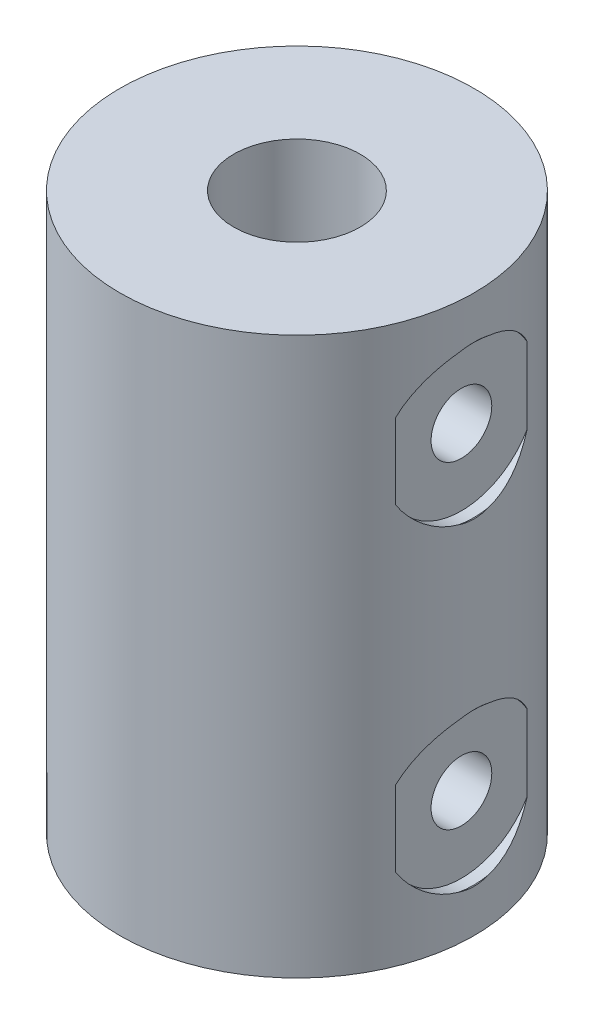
from build123d import *

# Parameters (mm, degrees)
SKETCH_2_R               = 7
EXTRUDE_1_DEPTH          = 11
CUT_EXTRUDE_1_DEPTH      = 25.124676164
CUT_EXTRUDE_1_DEPTH_BACK = 25.124676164
SKETCH_3_R               = 2.5
M2_AB_1_AT_2_COUNT       = 2
M2_AB_1_AT_2_PITCH       = 12.57447526


with BuildPart() as part:
    # Sketch 2 → Extrude 1 (new, symmetric)
    with BuildSketch(Plane(origin=(0, 0, 0), x_dir=(1, 0, 0), z_dir=(0, 1, 0))):
        with Locations(Location((0, 0, 0), (0, 0, 270))):
            Circle(SKETCH_2_R)
    extrude(amount=EXTRUDE_1_DEPTH, both=True)

    # Sketch 3 → Cut-Extrude 1 (cut, two sides: drawn at the far end of the back side and taken through both)
    with BuildSketch(Plane(origin=(0, 11, 0), x_dir=(1, 0, 0), z_dir=(0, 1, 0)).offset(-CUT_EXTRUDE_1_DEPTH_BACK)):
        with Locations(Location((0, 0, 0), (0, 0, 270))):
            Circle(SKETCH_3_R)
    extrude(amount=CUT_EXTRUDE_1_DEPTH + CUT_EXTRUDE_1_DEPTH_BACK, mode=Mode.SUBTRACT)

    # Sketch 8 → M2 _ AB _1 (revolve, cut)
    with BuildSketch(Plane(origin=(7, -6.28723763, 0), x_dir=(0, 0, -1), z_dir=(0, 1, 0))):
        Polygon((0, 0), (0, 7.721032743), (1.2, 7), (1.2, 0.5), (3, 0.5), (3, 0.025), (3.025, 0), align=None)
    m2_ab_1 = revolve(axis=Axis((13.35, -6.28723763, 0), (-1, 0, 0)), mode=Mode.SUBTRACT)

    # M2 _ AB _1 at 2: M2 _ AB _1 ×2
    with Locations(*[(0, i * M2_AB_1_AT_2_PITCH, 0) for i in range(1, M2_AB_1_AT_2_COUNT)]):
        add(m2_ab_1, mode=Mode.SUBTRACT)


solid = part.part
